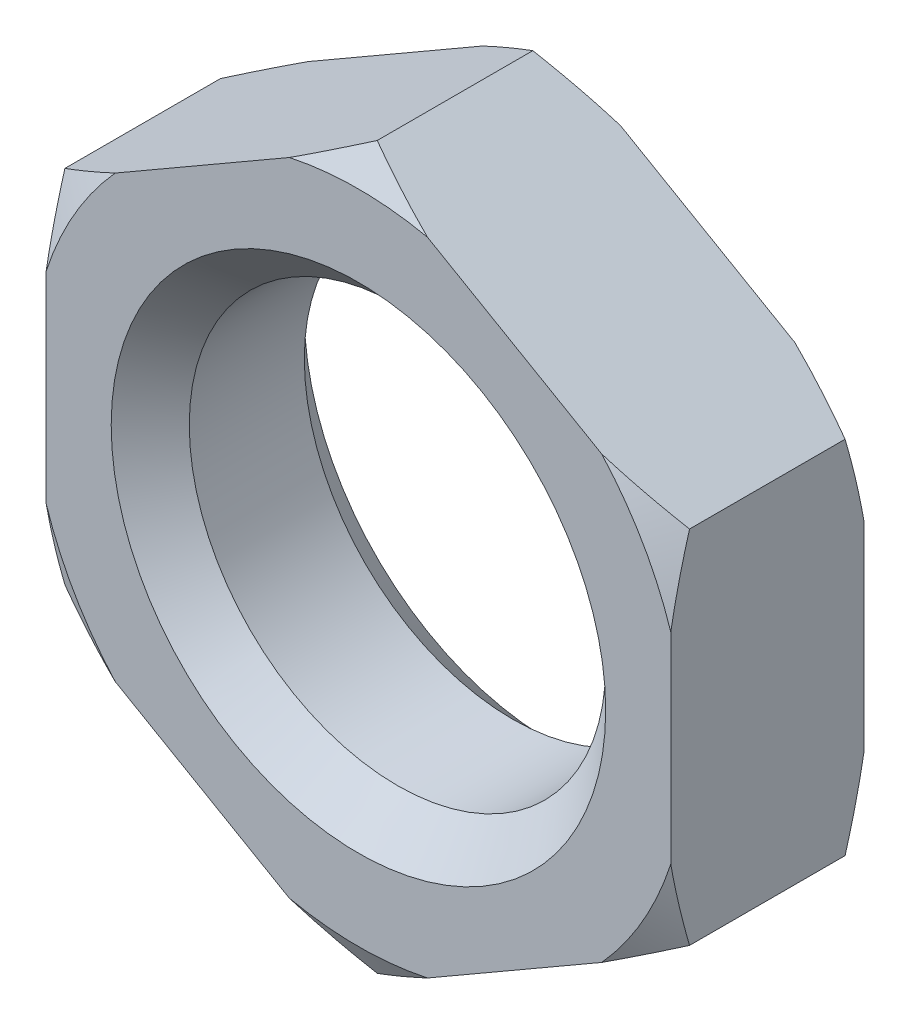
from build123d import *

# Parameters (mm, degrees)
SKETCH1_R           = 8
BOSS_EXTRUDE1_DEPTH = 3.71
CHAMFER1_SIZE       = 1.5


with BuildPart() as part:
    # Sketch1 → Boss-Extrude1 (new, symmetric)
    with BuildSketch(Plane.XY):
        Polygon((0, 13.856406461), (-12, 6.92820323), (-12, -6.92820323), (0, -13.856406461), (12, -6.92820323), (12, 6.92820323), align=None)
        with Locations(Location((0, 0, 0), (0, 0, 180))):
            Circle(SKETCH1_R, mode=Mode.SUBTRACT)
    extrude(amount=BOSS_EXTRUDE1_DEPTH, both=True)

    # Sketch3 → Cut-Revolve1 (revolve, cut)
    with BuildSketch(Plane(origin=(0, 0, 0), x_dir=(0, 0, -1), z_dir=(1, 0, 0))):
        Polygon((-3.71, 13.856406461), (-3.71, 12.606406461), (-2.988312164, 13.856406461), align=None)
    cut_revolve1 = revolve(axis=Axis((0, 0, -7.477018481), (0, 0, 1)), mode=Mode.SUBTRACT)

    # Mirror1: Cut-Revolve1 across plane
    add(cut_revolve1.mirror(Plane.XY), mode=Mode.SUBTRACT)

    # Chamfer1
    chamfer1_edges = [part.edges().sort_by_distance(p)[0] for p in [
        (8, 0, -3.71),
        (8, 0, 3.71),
    ]]
    chamfer(chamfer1_edges, length=CHAMFER1_SIZE)


solid = part.part
